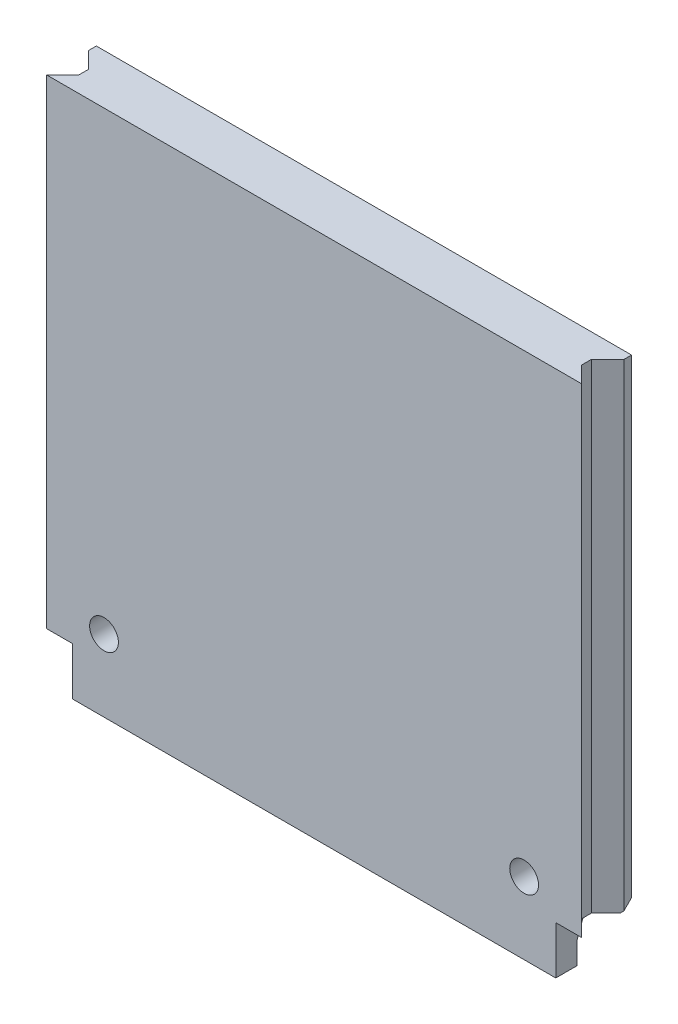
from build123d import *

# Parameters (mm, degrees)
BOSS_EXTRUDE1_DEPTH = 50
CHAMFER1_SIZE       = 1
SKETCH3_W           = 50.402270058
SKETCH3_H           = 3.2
BOSS_EXTRUDE2_DEPTH = 5
CUT_EXTRUDE1_DEPTH  = 73.998980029
SKETCH5_R           = 1.5
CUT_EXTRUDE2_DEPTH  = 58.493043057


with BuildPart() as part:
    # Sketch2 → Boss-Extrude1 (new body)
    with BuildSketch(Plane(origin=(0, 0, 0), x_dir=(1, 0, 0), z_dir=(0, 1, 0))):
        Polygon((-27.9, -2.2), (27.9, -2.2), (26.2, -0.5), (26.2, 0.5), (27.9, 2.2), (27.9, 3), (-27.9, 3), (-27.9, 2.2), (-26.2, 0.5), (-26.2, -0.5), align=None)
    extrude(amount=BOSS_EXTRUDE1_DEPTH)

    # Chamfer1
    chamfer1_edges = [part.edges().sort_by_distance(p)[0] for p in [
        (0, 0, -3),
    ]]
    chamfer(chamfer1_edges, length=CHAMFER1_SIZE)

    # Sketch3 → Boss-Extrude2 (add)
    with BuildSketch(Plane.XZ):
        with Locations((-0.001135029, 0.6)):
            Rectangle(SKETCH3_W, SKETCH3_H)
    extrude(amount=BOSS_EXTRUDE2_DEPTH)

    # Sketch4 → Cut-Extrude1 (cut, through all)
    with BuildSketch(Plane.ZY.offset(25.202270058)):
        Polygon((-1, 0), (0, -2.747477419), (0, -5), (-1, -5), align=None)
    extrude(amount=-CUT_EXTRUDE1_DEPTH, mode=Mode.SUBTRACT)

    # Sketch5 → Cut-Extrude2 (cut, through all)
    with BuildSketch(Plane(origin=(0, 0, -3), x_dir=(-1, 0, 0), z_dir=(0, 0, -1))):
        with Locations((-21.9, 2.5)):
            Circle(SKETCH5_R)
        with Locations(Location((21.9, 2.5, 0), (0, 0, 270))):
            Circle(SKETCH5_R)
    extrude(amount=-CUT_EXTRUDE2_DEPTH, mode=Mode.SUBTRACT)


solid = part.part
